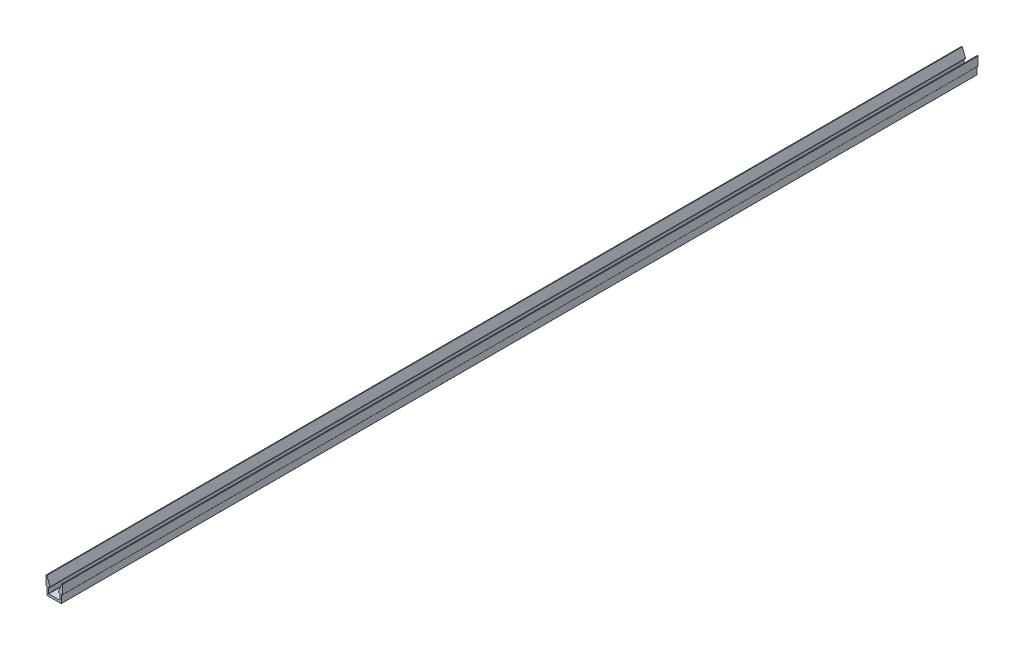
ISO-10303-21;
HEADER;
FILE_DESCRIPTION(('STEP AP214'),'2;1');
FILE_NAME('part.step','',(''),(''),'','','');
FILE_SCHEMA(('AUTOMOTIVE_DESIGN { 1 0 10303 214 1 1 1 1 }'));
ENDSEC;
DATA;
#1=APPLICATION_CONTEXT('core data for automotive mechanical design processes');
#2=APPLICATION_PROTOCOL_DEFINITION('international standard','automotive_design',2000,#1);
#3=PRODUCT_CONTEXT('',#1,'mechanical');
#4=PRODUCT('Part','Part','',(#3));
#5=PRODUCT_RELATED_PRODUCT_CATEGORY('part','',(#4));
#6=PRODUCT_DEFINITION_FORMATION('','',#4);
#7=PRODUCT_DEFINITION_CONTEXT('part definition',#1,'design');
#8=PRODUCT_DEFINITION('design','',#6,#7);
#9=PRODUCT_DEFINITION_SHAPE('','',#8);
#10=(LENGTH_UNIT() NAMED_UNIT(*) SI_UNIT(.MILLI.,.METRE.));
#11=(NAMED_UNIT(*) PLANE_ANGLE_UNIT() SI_UNIT($,.RADIAN.));
#12=(NAMED_UNIT(*) SI_UNIT($,.STERADIAN.) SOLID_ANGLE_UNIT());
#13=UNCERTAINTY_MEASURE_WITH_UNIT(LENGTH_MEASURE(1.E-05),#10,'distance_accuracy_value','');
#14=(GEOMETRIC_REPRESENTATION_CONTEXT(3) GLOBAL_UNCERTAINTY_ASSIGNED_CONTEXT((#13)) GLOBAL_UNIT_ASSIGNED_CONTEXT((#10,
#11,#12)) REPRESENTATION_CONTEXT('',''));
#15=CARTESIAN_POINT('',(0.,0.,0.));
#16=DIRECTION('',(0.,0.,1.));
#17=DIRECTION('',(1.,0.,0.));
#18=AXIS2_PLACEMENT_3D('',#15,#16,#17);
#19=CARTESIAN_POINT('',(3.1369,4.572,508.));
#20=DIRECTION('',(1.,0.,0.));
#21=DIRECTION('',(0.,1.,0.));
#22=AXIS2_PLACEMENT_3D('',#19,#20,#21);
#23=PLANE('',#22);
#24=DIRECTION('',(0.,-1.,0.));
#25=VECTOR('',#24,1.);
#26=CARTESIAN_POINT('',(3.1369,4.572,0.));
#27=LINE('',#26,#25);
#28=CARTESIAN_POINT('',(3.1369,4.572,0.));
#29=VERTEX_POINT('',#28);
#30=CARTESIAN_POINT('',(3.1369,1.397,0.));
#31=VERTEX_POINT('',#30);
#32=EDGE_CURVE('E214',#29,#31,#27,.T.);
#33=ORIENTED_EDGE('',*,*,#32,.T.);
#34=DIRECTION('',(0.,0.,-1.));
#35=VECTOR('',#34,1.);
#36=CARTESIAN_POINT('',(3.1369,1.397,508.));
#37=LINE('',#36,#35);
#38=CARTESIAN_POINT('',(3.1369,1.397,508.));
#39=VERTEX_POINT('',#38);
#40=EDGE_CURVE('E9',#39,#31,#37,.T.);
#41=ORIENTED_EDGE('',*,*,#40,.F.);
#42=DIRECTION('',(0.,-1.,0.));
#43=VECTOR('',#42,1.);
#44=CARTESIAN_POINT('',(3.1369,4.572,508.));
#45=LINE('',#44,#43);
#46=CARTESIAN_POINT('',(3.1369,4.572,508.));
#47=VERTEX_POINT('',#46);
#48=EDGE_CURVE('E285',#47,#39,#45,.T.);
#49=ORIENTED_EDGE('',*,*,#48,.F.);
#50=DIRECTION('',(0.,0.,-1.));
#51=VECTOR('',#50,1.);
#52=CARTESIAN_POINT('',(3.1369,4.572,508.));
#53=LINE('',#52,#51);
#54=EDGE_CURVE('E227',#47,#29,#53,.T.);
#55=ORIENTED_EDGE('',*,*,#54,.T.);
#56=EDGE_LOOP('',(#33,#41,#49,#55));
#57=FACE_BOUND('',#56,.T.);
#58=ADVANCED_FACE('F14',(#57),#23,.F.);
#59=CARTESIAN_POINT('',(3.0099,1.397,508.));
#60=DIRECTION('',(0.,0.,-1.));
#61=DIRECTION('',(-1.,0.,0.));
#62=AXIS2_PLACEMENT_3D('',#59,#60,#61);
#63=CYLINDRICAL_SURFACE('',#62,0.127);
#64=CARTESIAN_POINT('',(3.0099,1.397,0.));
#65=DIRECTION('',(0.,0.,-1.));
#66=DIRECTION('',(-1.,0.,0.));
#67=AXIS2_PLACEMENT_3D('',#64,#65,#66);
#68=CIRCLE('',#67,0.127);
#69=CARTESIAN_POINT('',(3.0099,1.27,0.));
#70=VERTEX_POINT('',#69);
#71=EDGE_CURVE('E210',#31,#70,#68,.T.);
#72=ORIENTED_EDGE('',*,*,#71,.T.);
#73=DIRECTION('',(0.,0.,-1.));
#74=VECTOR('',#73,1.);
#75=CARTESIAN_POINT('',(3.0099,1.27,508.));
#76=LINE('',#75,#74);
#77=CARTESIAN_POINT('',(3.0099,1.27,508.));
#78=VERTEX_POINT('',#77);
#79=EDGE_CURVE('E21',#78,#70,#76,.T.);
#80=ORIENTED_EDGE('',*,*,#79,.F.);
#81=CARTESIAN_POINT('',(3.0099,1.397,508.));
#82=DIRECTION('',(0.,0.,-1.));
#83=DIRECTION('',(-1.,0.,0.));
#84=AXIS2_PLACEMENT_3D('',#81,#82,#83);
#85=CIRCLE('',#84,0.127);
#86=EDGE_CURVE('E223',#39,#78,#85,.T.);
#87=ORIENTED_EDGE('',*,*,#86,.F.);
#88=ORIENTED_EDGE('',*,*,#40,.T.);
#89=EDGE_LOOP('',(#72,#80,#87,#88));
#90=FACE_BOUND('',#89,.T.);
#91=ADVANCED_FACE('F222',(#90),#63,.F.);
#92=CARTESIAN_POINT('',(3.0099,1.27,508.));
#93=DIRECTION('',(0.,-1.,0.));
#94=DIRECTION('',(0.,0.,-1.));
#95=AXIS2_PLACEMENT_3D('',#92,#93,#94);
#96=PLANE('',#95);
#97=DIRECTION('',(-1.,0.,0.));
#98=VECTOR('',#97,1.);
#99=CARTESIAN_POINT('',(3.0099,1.27,0.));
#100=LINE('',#99,#98);
#101=CARTESIAN_POINT('',(-3.0099,1.27,0.));
#102=VERTEX_POINT('',#101);
#103=EDGE_CURVE('E216',#70,#102,#100,.T.);
#104=ORIENTED_EDGE('',*,*,#103,.T.);
#105=DIRECTION('',(0.,0.,-1.));
#106=VECTOR('',#105,1.);
#107=CARTESIAN_POINT('',(-3.0099,1.27,508.));
#108=LINE('',#107,#106);
#109=CARTESIAN_POINT('',(-3.0099,1.27,508.));
#110=VERTEX_POINT('',#109);
#111=EDGE_CURVE('E421',#110,#102,#108,.T.);
#112=ORIENTED_EDGE('',*,*,#111,.F.);
#113=DIRECTION('',(-1.,0.,0.));
#114=VECTOR('',#113,1.);
#115=CARTESIAN_POINT('',(3.0099,1.27,508.));
#116=LINE('',#115,#114);
#117=EDGE_CURVE('E288',#78,#110,#116,.T.);
#118=ORIENTED_EDGE('',*,*,#117,.F.);
#119=ORIENTED_EDGE('',*,*,#79,.T.);
#120=EDGE_LOOP('',(#104,#112,#118,#119));
#121=FACE_BOUND('',#120,.T.);
#122=ADVANCED_FACE('F425',(#121),#96,.F.);
#123=CARTESIAN_POINT('',(-3.0099,1.397,508.));
#124=DIRECTION('',(0.,0.,-1.));
#125=DIRECTION('',(-1.,0.,0.));
#126=AXIS2_PLACEMENT_3D('',#123,#124,#125);
#127=CYLINDRICAL_SURFACE('',#126,0.127);
#128=CARTESIAN_POINT('',(-3.0099,1.397,0.));
#129=DIRECTION('',(0.,0.,-1.));
#130=DIRECTION('',(1.,0.,0.));
#131=AXIS2_PLACEMENT_3D('',#128,#129,#130);
#132=CIRCLE('',#131,0.127);
#133=CARTESIAN_POINT('',(-3.1369,1.397,0.));
#134=VERTEX_POINT('',#133);
#135=EDGE_CURVE('E231',#102,#134,#132,.T.);
#136=ORIENTED_EDGE('',*,*,#135,.T.);
#137=DIRECTION('',(0.,0.,-1.));
#138=VECTOR('',#137,1.);
#139=CARTESIAN_POINT('',(-3.1369,1.397,508.));
#140=LINE('',#139,#138);
#141=CARTESIAN_POINT('',(-3.1369,1.397,508.));
#142=VERTEX_POINT('',#141);
#143=EDGE_CURVE('E418',#142,#134,#140,.T.);
#144=ORIENTED_EDGE('',*,*,#143,.F.);
#145=CARTESIAN_POINT('',(-3.0099,1.397,508.));
#146=DIRECTION('',(0.,0.,-1.));
#147=DIRECTION('',(1.,0.,0.));
#148=AXIS2_PLACEMENT_3D('',#145,#146,#147);
#149=CIRCLE('',#148,0.127);
#150=EDGE_CURVE('E290',#110,#142,#149,.T.);
#151=ORIENTED_EDGE('',*,*,#150,.F.);
#152=ORIENTED_EDGE('',*,*,#111,.T.);
#153=EDGE_LOOP('',(#136,#144,#151,#152));
#154=FACE_BOUND('',#153,.T.);
#155=ADVANCED_FACE('F433',(#154),#127,.F.);
#156=CARTESIAN_POINT('',(-3.1369,4.572,508.));
#157=DIRECTION('',(-1.,0.,0.));
#158=DIRECTION('',(0.,-1.,0.));
#159=AXIS2_PLACEMENT_3D('',#156,#157,#158);
#160=PLANE('',#159);
#161=DIRECTION('',(0.,1.,0.));
#162=VECTOR('',#161,1.);
#163=CARTESIAN_POINT('',(-3.1369,4.572,0.));
#164=LINE('',#163,#162);
#165=CARTESIAN_POINT('',(-3.1369,4.572,0.));
#166=VERTEX_POINT('',#165);
#167=EDGE_CURVE('E233',#134,#166,#164,.T.);
#168=ORIENTED_EDGE('',*,*,#167,.T.);
#169=DIRECTION('',(0.,0.,-1.));
#170=VECTOR('',#169,1.);
#171=CARTESIAN_POINT('',(-3.1369,4.572,508.));
#172=LINE('',#171,#170);
#173=CARTESIAN_POINT('',(-3.1369,4.572,508.));
#174=VERTEX_POINT('',#173);
#175=EDGE_CURVE('E415',#174,#166,#172,.T.);
#176=ORIENTED_EDGE('',*,*,#175,.F.);
#177=DIRECTION('',(0.,1.,0.));
#178=VECTOR('',#177,1.);
#179=CARTESIAN_POINT('',(-3.1369,4.572,508.));
#180=LINE('',#179,#178);
#181=EDGE_CURVE('E292',#142,#174,#180,.T.);
#182=ORIENTED_EDGE('',*,*,#181,.F.);
#183=ORIENTED_EDGE('',*,*,#143,.T.);
#184=EDGE_LOOP('',(#168,#176,#182,#183));
#185=FACE_BOUND('',#184,.T.);
#186=ADVANCED_FACE('F436',(#185),#160,.F.);
#187=CARTESIAN_POINT('',(-2.70340250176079,4.572,508.));
#188=DIRECTION('',(0.,1.,0.));
#189=DIRECTION('',(-1.,0.,0.));
#190=AXIS2_PLACEMENT_3D('',#187,#188,#189);
#191=PLANE('',#190);
#192=DIRECTION('',(1.,0.,0.));
#193=VECTOR('',#192,1.);
#194=CARTESIAN_POINT('',(-2.70340250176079,4.572,0.));
#195=LINE('',#194,#193);
#196=CARTESIAN_POINT('',(-2.70340250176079,4.572,0.));
#197=VERTEX_POINT('',#196);
#198=EDGE_CURVE('E235',#166,#197,#195,.T.);
#199=ORIENTED_EDGE('',*,*,#198,.T.);
#200=DIRECTION('',(0.,0.,-1.));
#201=VECTOR('',#200,1.);
#202=CARTESIAN_POINT('',(-2.70340250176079,4.572,508.));
#203=LINE('',#202,#201);
#204=CARTESIAN_POINT('',(-2.70340250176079,4.572,508.));
#205=VERTEX_POINT('',#204);
#206=EDGE_CURVE('E412',#205,#197,#203,.T.);
#207=ORIENTED_EDGE('',*,*,#206,.F.);
#208=DIRECTION('',(1.,0.,0.));
#209=VECTOR('',#208,1.);
#210=CARTESIAN_POINT('',(-2.70340250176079,4.572,508.));
#211=LINE('',#210,#209);
#212=EDGE_CURVE('E294',#174,#205,#211,.T.);
#213=ORIENTED_EDGE('',*,*,#212,.F.);
#214=ORIENTED_EDGE('',*,*,#175,.T.);
#215=EDGE_LOOP('',(#199,#207,#213,#214));
#216=FACE_BOUND('',#215,.T.);
#217=ADVANCED_FACE('F441',(#216),#191,.F.);
#218=CARTESIAN_POINT('',(-2.70340250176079,4.953,508.));
#219=DIRECTION('',(0.,0.,-1.));
#220=DIRECTION('',(-1.,0.,0.));
#221=AXIS2_PLACEMENT_3D('',#218,#219,#220);
#222=CYLINDRICAL_SURFACE('',#221,0.381);
#223=CARTESIAN_POINT('',(-2.70340250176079,4.953,0.));
#224=DIRECTION('',(0.,0.,1.));
#225=DIRECTION('',(-1.,0.,0.));
#226=AXIS2_PLACEMENT_3D('',#223,#224,#225);
#227=CIRCLE('',#226,0.381);
#228=CARTESIAN_POINT('',(-2.35014545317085,5.09572511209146,0.));
#229=VERTEX_POINT('',#228);
#230=EDGE_CURVE('E237',#197,#229,#227,.T.);
#231=ORIENTED_EDGE('',*,*,#230,.T.);
#232=DIRECTION('',(0.,0.,-1.));
#233=VECTOR('',#232,1.);
#234=CARTESIAN_POINT('',(-2.35014545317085,5.09572511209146,508.));
#235=LINE('',#234,#233);
#236=CARTESIAN_POINT('',(-2.35014545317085,5.09572511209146,508.));
#237=VERTEX_POINT('',#236);
#238=EDGE_CURVE('E409',#237,#229,#235,.T.);
#239=ORIENTED_EDGE('',*,*,#238,.F.);
#240=CARTESIAN_POINT('',(-2.70340250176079,4.953,508.));
#241=DIRECTION('',(0.,0.,1.));
#242=DIRECTION('',(-1.,0.,0.));
#243=AXIS2_PLACEMENT_3D('',#240,#241,#242);
#244=CIRCLE('',#243,0.381);
#245=EDGE_CURVE('E296',#205,#237,#244,.T.);
#246=ORIENTED_EDGE('',*,*,#245,.F.);
#247=ORIENTED_EDGE('',*,*,#206,.T.);
#248=EDGE_LOOP('',(#231,#239,#246,#247));
#249=FACE_BOUND('',#248,.T.);
#250=ADVANCED_FACE('F447',(#249),#222,.T.);
#251=CARTESIAN_POINT('',(-4.15891023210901,9.57257503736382,508.));
#252=DIRECTION('',(-0.92718385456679,-0.374606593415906,0.));
#253=DIRECTION('',(0.374606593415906,-0.92718385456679,0.));
#254=AXIS2_PLACEMENT_3D('',#251,#252,#253);
#255=PLANE('',#254);
#256=DIRECTION('',(-0.374606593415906,0.92718385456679,0.));
#257=VECTOR('',#256,1.);
#258=CARTESIAN_POINT('',(-4.15891023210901,9.57257503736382,0.));
#259=LINE('',#258,#257);
#260=CARTESIAN_POINT('',(-4.158910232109,9.57257503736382,0.));
#261=VERTEX_POINT('',#260);
#262=EDGE_CURVE('E239',#229,#261,#259,.T.);
#263=ORIENTED_EDGE('',*,*,#262,.T.);
#264=DIRECTION('',(0.,0.,-1.));
#265=VECTOR('',#264,1.);
#266=CARTESIAN_POINT('',(-4.158910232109,9.57257503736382,508.));
#267=LINE('',#266,#265);
#268=CARTESIAN_POINT('',(-4.158910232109,9.57257503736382,508.));
#269=VERTEX_POINT('',#268);
#270=EDGE_CURVE('E406',#269,#261,#267,.T.);
#271=ORIENTED_EDGE('',*,*,#270,.F.);
#272=DIRECTION('',(-0.374606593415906,0.92718385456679,0.));
#273=VECTOR('',#272,1.);
#274=CARTESIAN_POINT('',(-4.15891023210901,9.57257503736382,508.));
#275=LINE('',#274,#273);
#276=EDGE_CURVE('E298',#237,#269,#275,.T.);
#277=ORIENTED_EDGE('',*,*,#276,.F.);
#278=ORIENTED_EDGE('',*,*,#238,.T.);
#279=EDGE_LOOP('',(#263,#271,#277,#278));
#280=FACE_BOUND('',#279,.T.);
#281=ADVANCED_FACE('F451',(#280),#255,.F.);
#282=CARTESIAN_POINT('',(-4.27666258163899,9.525,508.));
#283=DIRECTION('',(0.,0.,-1.));
#284=DIRECTION('',(-1.,0.,0.));
#285=AXIS2_PLACEMENT_3D('',#282,#283,#284);
#286=CYLINDRICAL_SURFACE('',#285,0.127);
#287=CARTESIAN_POINT('',(-4.27666258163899,9.525,0.));
#288=DIRECTION('',(0.,0.,1.));
#289=DIRECTION('',(-1.,0.,0.));
#290=AXIS2_PLACEMENT_3D('',#287,#288,#289);
#291=CIRCLE('',#290,0.127);
#292=CARTESIAN_POINT('',(-4.27666258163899,9.652,0.));
#293=VERTEX_POINT('',#292);
#294=EDGE_CURVE('E241',#261,#293,#291,.T.);
#295=ORIENTED_EDGE('',*,*,#294,.T.);
#296=DIRECTION('',(0.,0.,-1.));
#297=VECTOR('',#296,1.);
#298=CARTESIAN_POINT('',(-4.27666258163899,9.652,508.));
#299=LINE('',#298,#297);
#300=CARTESIAN_POINT('',(-4.27666258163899,9.652,508.));
#301=VERTEX_POINT('',#300);
#302=EDGE_CURVE('E403',#301,#293,#299,.T.);
#303=ORIENTED_EDGE('',*,*,#302,.F.);
#304=CARTESIAN_POINT('',(-4.27666258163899,9.525,508.));
#305=DIRECTION('',(0.,0.,1.));
#306=DIRECTION('',(-1.,0.,0.));
#307=AXIS2_PLACEMENT_3D('',#304,#305,#306);
#308=CIRCLE('',#307,0.127);
#309=EDGE_CURVE('E300',#269,#301,#308,.T.);
#310=ORIENTED_EDGE('',*,*,#309,.F.);
#311=ORIENTED_EDGE('',*,*,#270,.T.);
#312=EDGE_LOOP('',(#295,#303,#310,#311));
#313=FACE_BOUND('',#312,.T.);
#314=ADVANCED_FACE('F456',(#313),#286,.T.);
#315=CARTESIAN_POINT('',(-4.445,9.652,508.));
#316=DIRECTION('',(0.,-1.,0.));
#317=DIRECTION('',(1.,0.,0.));
#318=AXIS2_PLACEMENT_3D('',#315,#316,#317);
#319=PLANE('',#318);
#320=DIRECTION('',(-1.,0.,0.));
#321=VECTOR('',#320,1.);
#322=CARTESIAN_POINT('',(-4.445,9.652,0.));
#323=LINE('',#322,#321);
#324=CARTESIAN_POINT('',(-4.445,9.652,0.));
#325=VERTEX_POINT('',#324);
#326=EDGE_CURVE('E243',#293,#325,#323,.T.);
#327=ORIENTED_EDGE('',*,*,#326,.T.);
#328=DIRECTION('',(0.,0.,-1.));
#329=VECTOR('',#328,1.);
#330=CARTESIAN_POINT('',(-4.445,9.652,508.));
#331=LINE('',#330,#329);
#332=CARTESIAN_POINT('',(-4.445,9.652,508.));
#333=VERTEX_POINT('',#332);
#334=EDGE_CURVE('E400',#333,#325,#331,.T.);
#335=ORIENTED_EDGE('',*,*,#334,.F.);
#336=DIRECTION('',(-1.,0.,0.));
#337=VECTOR('',#336,1.);
#338=CARTESIAN_POINT('',(-4.445,9.652,508.));
#339=LINE('',#338,#337);
#340=EDGE_CURVE('E302',#301,#333,#339,.T.);
#341=ORIENTED_EDGE('',*,*,#340,.F.);
#342=ORIENTED_EDGE('',*,*,#302,.T.);
#343=EDGE_LOOP('',(#327,#335,#341,#342));
#344=FACE_BOUND('',#343,.T.);
#345=ADVANCED_FACE('F462',(#344),#319,.F.);
#346=CARTESIAN_POINT('',(-4.445,9.525,508.));
#347=DIRECTION('',(0.,0.,-1.));
#348=DIRECTION('',(-1.,0.,0.));
#349=AXIS2_PLACEMENT_3D('',#346,#347,#348);
#350=CYLINDRICAL_SURFACE('',#349,0.127);
#351=CARTESIAN_POINT('',(-4.445,9.525,0.));
#352=DIRECTION('',(0.,0.,1.));
#353=DIRECTION('',(-1.,0.,0.));
#354=AXIS2_PLACEMENT_3D('',#351,#352,#353);
#355=CIRCLE('',#354,0.127);
#356=CARTESIAN_POINT('',(-4.572,9.525,0.));
#357=VERTEX_POINT('',#356);
#358=EDGE_CURVE('E245',#325,#357,#355,.T.);
#359=ORIENTED_EDGE('',*,*,#358,.T.);
#360=DIRECTION('',(0.,0.,-1.));
#361=VECTOR('',#360,1.);
#362=CARTESIAN_POINT('',(-4.572,9.525,508.));
#363=LINE('',#362,#361);
#364=CARTESIAN_POINT('',(-4.572,9.525,508.));
#365=VERTEX_POINT('',#364);
#366=EDGE_CURVE('E397',#365,#357,#363,.T.);
#367=ORIENTED_EDGE('',*,*,#366,.F.);
#368=CARTESIAN_POINT('',(-4.445,9.525,508.));
#369=DIRECTION('',(0.,0.,1.));
#370=DIRECTION('',(-1.,0.,0.));
#371=AXIS2_PLACEMENT_3D('',#368,#369,#370);
#372=CIRCLE('',#371,0.127);
#373=EDGE_CURVE('E304',#333,#365,#372,.T.);
#374=ORIENTED_EDGE('',*,*,#373,.F.);
#375=ORIENTED_EDGE('',*,*,#334,.T.);
#376=EDGE_LOOP('',(#359,#367,#374,#375));
#377=FACE_BOUND('',#376,.T.);
#378=ADVANCED_FACE('F466',(#377),#350,.T.);
#379=CARTESIAN_POINT('',(-4.572,4.699,508.));
#380=DIRECTION('',(1.,0.,0.));
#381=DIRECTION('',(0.,1.,0.));
#382=AXIS2_PLACEMENT_3D('',#379,#380,#381);
#383=PLANE('',#382);
#384=DIRECTION('',(0.,-1.,0.));
#385=VECTOR('',#384,1.);
#386=CARTESIAN_POINT('',(-4.572,4.699,0.));
#387=LINE('',#386,#385);
#388=CARTESIAN_POINT('',(-4.572,4.699,0.));
#389=VERTEX_POINT('',#388);
#390=EDGE_CURVE('E247',#357,#389,#387,.T.);
#391=ORIENTED_EDGE('',*,*,#390,.T.);
#392=DIRECTION('',(0.,0.,-1.));
#393=VECTOR('',#392,1.);
#394=CARTESIAN_POINT('',(-4.572,4.699,508.));
#395=LINE('',#394,#393);
#396=CARTESIAN_POINT('',(-4.572,4.699,508.));
#397=VERTEX_POINT('',#396);
#398=EDGE_CURVE('E394',#397,#389,#395,.T.);
#399=ORIENTED_EDGE('',*,*,#398,.F.);
#400=DIRECTION('',(0.,-1.,0.));
#401=VECTOR('',#400,1.);
#402=CARTESIAN_POINT('',(-4.572,4.699,508.));
#403=LINE('',#402,#401);
#404=EDGE_CURVE('E306',#365,#397,#403,.T.);
#405=ORIENTED_EDGE('',*,*,#404,.F.);
#406=ORIENTED_EDGE('',*,*,#366,.T.);
#407=EDGE_LOOP('',(#391,#399,#405,#406));
#408=FACE_BOUND('',#407,.T.);
#409=ADVANCED_FACE('F471',(#408),#383,.F.);
#410=CARTESIAN_POINT('',(-4.445,4.699,508.));
#411=DIRECTION('',(0.,0.,-1.));
#412=DIRECTION('',(-1.,0.,0.));
#413=AXIS2_PLACEMENT_3D('',#410,#411,#412);
#414=CYLINDRICAL_SURFACE('',#413,0.127);
#415=CARTESIAN_POINT('',(-4.445,4.699,0.));
#416=DIRECTION('',(0.,0.,1.));
#417=DIRECTION('',(-1.,0.,0.));
#418=AXIS2_PLACEMENT_3D('',#415,#416,#417);
#419=CIRCLE('',#418,0.127);
#420=CARTESIAN_POINT('',(-4.445,4.572,0.));
#421=VERTEX_POINT('',#420);
#422=EDGE_CURVE('E249',#389,#421,#419,.T.);
#423=ORIENTED_EDGE('',*,*,#422,.T.);
#424=DIRECTION('',(0.,0.,-1.));
#425=VECTOR('',#424,1.);
#426=CARTESIAN_POINT('',(-4.445,4.572,508.));
#427=LINE('',#426,#425);
#428=CARTESIAN_POINT('',(-4.445,4.572,508.));
#429=VERTEX_POINT('',#428);
#430=EDGE_CURVE('E391',#429,#421,#427,.T.);
#431=ORIENTED_EDGE('',*,*,#430,.F.);
#432=CARTESIAN_POINT('',(-4.445,4.699,508.));
#433=DIRECTION('',(0.,0.,1.));
#434=DIRECTION('',(-1.,0.,0.));
#435=AXIS2_PLACEMENT_3D('',#432,#433,#434);
#436=CIRCLE('',#435,0.127);
#437=EDGE_CURVE('E308',#397,#429,#436,.T.);
#438=ORIENTED_EDGE('',*,*,#437,.F.);
#439=ORIENTED_EDGE('',*,*,#398,.T.);
#440=EDGE_LOOP('',(#423,#431,#438,#439));
#441=FACE_BOUND('',#440,.T.);
#442=ADVANCED_FACE('F477',(#441),#414,.T.);
#443=CARTESIAN_POINT('',(-4.064,4.572,508.));
#444=DIRECTION('',(0.,1.,0.));
#445=DIRECTION('',(0.,0.,1.));
#446=AXIS2_PLACEMENT_3D('',#443,#444,#445);
#447=PLANE('',#446);
#448=DIRECTION('',(1.,0.,0.));
#449=VECTOR('',#448,1.);
#450=CARTESIAN_POINT('',(-4.064,4.572,0.));
#451=LINE('',#450,#449);
#452=CARTESIAN_POINT('',(-4.064,4.572,0.));
#453=VERTEX_POINT('',#452);
#454=EDGE_CURVE('E251',#421,#453,#451,.T.);
#455=ORIENTED_EDGE('',*,*,#454,.T.);
#456=DIRECTION('',(0.,0.,-1.));
#457=VECTOR('',#456,1.);
#458=CARTESIAN_POINT('',(-4.064,4.572,508.));
#459=LINE('',#458,#457);
#460=CARTESIAN_POINT('',(-4.064,4.572,508.));
#461=VERTEX_POINT('',#460);
#462=EDGE_CURVE('E388',#461,#453,#459,.T.);
#463=ORIENTED_EDGE('',*,*,#462,.F.);
#464=DIRECTION('',(1.,0.,0.));
#465=VECTOR('',#464,1.);
#466=CARTESIAN_POINT('',(-4.064,4.572,508.));
#467=LINE('',#466,#465);
#468=EDGE_CURVE('E310',#429,#461,#467,.T.);
#469=ORIENTED_EDGE('',*,*,#468,.F.);
#470=ORIENTED_EDGE('',*,*,#430,.T.);
#471=EDGE_LOOP('',(#455,#463,#469,#470));
#472=FACE_BOUND('',#471,.T.);
#473=ADVANCED_FACE('F481',(#472),#447,.F.);
#474=CARTESIAN_POINT('',(-4.064,4.445,508.));
#475=DIRECTION('',(0.,0.,-1.));
#476=DIRECTION('',(-1.,0.,0.));
#477=AXIS2_PLACEMENT_3D('',#474,#475,#476);
#478=CYLINDRICAL_SURFACE('',#477,0.127);
#479=CARTESIAN_POINT('',(-4.064,4.445,0.));
#480=DIRECTION('',(0.,0.,-1.));
#481=DIRECTION('',(1.,0.,0.));
#482=AXIS2_PLACEMENT_3D('',#479,#480,#481);
#483=CIRCLE('',#482,0.127);
#484=CARTESIAN_POINT('',(-3.937,4.445,0.));
#485=VERTEX_POINT('',#484);
#486=EDGE_CURVE('E253',#453,#485,#483,.T.);
#487=ORIENTED_EDGE('',*,*,#486,.T.);
#488=DIRECTION('',(0.,0.,-1.));
#489=VECTOR('',#488,1.);
#490=CARTESIAN_POINT('',(-3.937,4.445,508.));
#491=LINE('',#490,#489);
#492=CARTESIAN_POINT('',(-3.937,4.445,508.));
#493=VERTEX_POINT('',#492);
#494=EDGE_CURVE('E385',#493,#485,#491,.T.);
#495=ORIENTED_EDGE('',*,*,#494,.F.);
#496=CARTESIAN_POINT('',(-4.064,4.445,508.));
#497=DIRECTION('',(0.,0.,-1.));
#498=DIRECTION('',(1.,0.,0.));
#499=AXIS2_PLACEMENT_3D('',#496,#497,#498);
#500=CIRCLE('',#499,0.127);
#501=EDGE_CURVE('E312',#461,#493,#500,.T.);
#502=ORIENTED_EDGE('',*,*,#501,.F.);
#503=ORIENTED_EDGE('',*,*,#462,.T.);
#504=EDGE_LOOP('',(#487,#495,#502,#503));
#505=FACE_BOUND('',#504,.T.);
#506=ADVANCED_FACE('F486',(#505),#478,.F.);
#507=CARTESIAN_POINT('',(-3.937,0.127,508.));
#508=DIRECTION('',(1.,0.,0.));
#509=DIRECTION('',(0.,0.,-1.));
#510=AXIS2_PLACEMENT_3D('',#507,#508,#509);
#511=PLANE('',#510);
#512=DIRECTION('',(0.,-1.,0.));
#513=VECTOR('',#512,1.);
#514=CARTESIAN_POINT('',(-3.937,0.127,0.));
#515=LINE('',#514,#513);
#516=CARTESIAN_POINT('',(-3.937,0.127,0.));
#517=VERTEX_POINT('',#516);
#518=EDGE_CURVE('E255',#485,#517,#515,.T.);
#519=ORIENTED_EDGE('',*,*,#518,.T.);
#520=DIRECTION('',(0.,0.,-1.));
#521=VECTOR('',#520,1.);
#522=CARTESIAN_POINT('',(-3.937,0.127,508.));
#523=LINE('',#522,#521);
#524=CARTESIAN_POINT('',(-3.937,0.127,508.));
#525=VERTEX_POINT('',#524);
#526=EDGE_CURVE('E382',#525,#517,#523,.T.);
#527=ORIENTED_EDGE('',*,*,#526,.F.);
#528=DIRECTION('',(0.,-1.,0.));
#529=VECTOR('',#528,1.);
#530=CARTESIAN_POINT('',(-3.937,0.127,508.));
#531=LINE('',#530,#529);
#532=EDGE_CURVE('E314',#493,#525,#531,.T.);
#533=ORIENTED_EDGE('',*,*,#532,.F.);
#534=ORIENTED_EDGE('',*,*,#494,.T.);
#535=EDGE_LOOP('',(#519,#527,#533,#534));
#536=FACE_BOUND('',#535,.T.);
#537=ADVANCED_FACE('F492',(#536),#511,.F.);
#538=CARTESIAN_POINT('',(-3.81,0.127,508.));
#539=DIRECTION('',(0.,0.,-1.));
#540=DIRECTION('',(-1.,0.,0.));
#541=AXIS2_PLACEMENT_3D('',#538,#539,#540);
#542=CYLINDRICAL_SURFACE('',#541,0.127);
#543=CARTESIAN_POINT('',(-3.81,0.127,0.));
#544=DIRECTION('',(0.,0.,1.));
#545=DIRECTION('',(-1.,0.,0.));
#546=AXIS2_PLACEMENT_3D('',#543,#544,#545);
#547=CIRCLE('',#546,0.127);
#548=CARTESIAN_POINT('',(-3.81,0.,0.));
#549=VERTEX_POINT('',#548);
#550=EDGE_CURVE('E257',#517,#549,#547,.T.);
#551=ORIENTED_EDGE('',*,*,#550,.T.);
#552=DIRECTION('',(0.,0.,-1.));
#553=VECTOR('',#552,1.);
#554=CARTESIAN_POINT('',(-3.81,0.,508.));
#555=LINE('',#554,#553);
#556=CARTESIAN_POINT('',(-3.81,0.,508.));
#557=VERTEX_POINT('',#556);
#558=EDGE_CURVE('E379',#557,#549,#555,.T.);
#559=ORIENTED_EDGE('',*,*,#558,.F.);
#560=CARTESIAN_POINT('',(-3.81,0.127,508.));
#561=DIRECTION('',(0.,0.,1.));
#562=DIRECTION('',(-1.,0.,0.));
#563=AXIS2_PLACEMENT_3D('',#560,#561,#562);
#564=CIRCLE('',#563,0.127);
#565=EDGE_CURVE('E316',#525,#557,#564,.T.);
#566=ORIENTED_EDGE('',*,*,#565,.F.);
#567=ORIENTED_EDGE('',*,*,#526,.T.);
#568=EDGE_LOOP('',(#551,#559,#566,#567));
#569=FACE_BOUND('',#568,.T.);
#570=ADVANCED_FACE('F496',(#569),#542,.T.);
#571=CARTESIAN_POINT('',(-3.81,0.,508.));
#572=DIRECTION('',(0.,1.,0.));
#573=DIRECTION('',(0.,0.,1.));
#574=AXIS2_PLACEMENT_3D('',#571,#572,#573);
#575=PLANE('',#574);
#576=DIRECTION('',(1.,0.,0.));
#577=VECTOR('',#576,1.);
#578=CARTESIAN_POINT('',(-3.81,0.,0.));
#579=LINE('',#578,#577);
#580=CARTESIAN_POINT('',(3.81,0.,0.));
#581=VERTEX_POINT('',#580);
#582=EDGE_CURVE('E259',#549,#581,#579,.T.);
#583=ORIENTED_EDGE('',*,*,#582,.T.);
#584=DIRECTION('',(0.,0.,-1.));
#585=VECTOR('',#584,1.);
#586=CARTESIAN_POINT('',(3.81,0.,508.));
#587=LINE('',#586,#585);
#588=CARTESIAN_POINT('',(3.81,0.,508.));
#589=VERTEX_POINT('',#588);
#590=EDGE_CURVE('E376',#589,#581,#587,.T.);
#591=ORIENTED_EDGE('',*,*,#590,.F.);
#592=DIRECTION('',(1.,0.,0.));
#593=VECTOR('',#592,1.);
#594=CARTESIAN_POINT('',(-3.81,0.,508.));
#595=LINE('',#594,#593);
#596=EDGE_CURVE('E318',#557,#589,#595,.T.);
#597=ORIENTED_EDGE('',*,*,#596,.F.);
#598=ORIENTED_EDGE('',*,*,#558,.T.);
#599=EDGE_LOOP('',(#583,#591,#597,#598));
#600=FACE_BOUND('',#599,.T.);
#601=ADVANCED_FACE('F501',(#600),#575,.F.);
#602=CARTESIAN_POINT('',(3.81,0.127,508.));
#603=DIRECTION('',(0.,0.,-1.));
#604=DIRECTION('',(-1.,0.,0.));
#605=AXIS2_PLACEMENT_3D('',#602,#603,#604);
#606=CYLINDRICAL_SURFACE('',#605,0.127);
#607=CARTESIAN_POINT('',(3.81,0.127,0.));
#608=DIRECTION('',(0.,0.,1.));
#609=DIRECTION('',(1.,0.,0.));
#610=AXIS2_PLACEMENT_3D('',#607,#608,#609);
#611=CIRCLE('',#610,0.127);
#612=CARTESIAN_POINT('',(3.937,0.127,0.));
#613=VERTEX_POINT('',#612);
#614=EDGE_CURVE('E261',#581,#613,#611,.T.);
#615=ORIENTED_EDGE('',*,*,#614,.T.);
#616=DIRECTION('',(0.,0.,-1.));
#617=VECTOR('',#616,1.);
#618=CARTESIAN_POINT('',(3.937,0.127,508.));
#619=LINE('',#618,#617);
#620=CARTESIAN_POINT('',(3.937,0.127,508.));
#621=VERTEX_POINT('',#620);
#622=EDGE_CURVE('E373',#621,#613,#619,.T.);
#623=ORIENTED_EDGE('',*,*,#622,.F.);
#624=CARTESIAN_POINT('',(3.81,0.127,508.));
#625=DIRECTION('',(0.,0.,1.));
#626=DIRECTION('',(1.,0.,0.));
#627=AXIS2_PLACEMENT_3D('',#624,#625,#626);
#628=CIRCLE('',#627,0.127);
#629=EDGE_CURVE('E320',#589,#621,#628,.T.);
#630=ORIENTED_EDGE('',*,*,#629,.F.);
#631=ORIENTED_EDGE('',*,*,#590,.T.);
#632=EDGE_LOOP('',(#615,#623,#630,#631));
#633=FACE_BOUND('',#632,.T.);
#634=ADVANCED_FACE('F507',(#633),#606,.T.);
#635=CARTESIAN_POINT('',(3.937,0.127,508.));
#636=DIRECTION('',(-1.,0.,0.));
#637=DIRECTION('',(0.,0.,1.));
#638=AXIS2_PLACEMENT_3D('',#635,#636,#637);
#639=PLANE('',#638);
#640=DIRECTION('',(0.,1.,0.));
#641=VECTOR('',#640,1.);
#642=CARTESIAN_POINT('',(3.937,0.127,0.));
#643=LINE('',#642,#641);
#644=CARTESIAN_POINT('',(3.937,4.445,0.));
#645=VERTEX_POINT('',#644);
#646=EDGE_CURVE('E263',#613,#645,#643,.T.);
#647=ORIENTED_EDGE('',*,*,#646,.T.);
#648=DIRECTION('',(0.,0.,-1.));
#649=VECTOR('',#648,1.);
#650=CARTESIAN_POINT('',(3.937,4.445,508.));
#651=LINE('',#650,#649);
#652=CARTESIAN_POINT('',(3.937,4.445,508.));
#653=VERTEX_POINT('',#652);
#654=EDGE_CURVE('E370',#653,#645,#651,.T.);
#655=ORIENTED_EDGE('',*,*,#654,.F.);
#656=DIRECTION('',(0.,1.,0.));
#657=VECTOR('',#656,1.);
#658=CARTESIAN_POINT('',(3.937,0.127,508.));
#659=LINE('',#658,#657);
#660=EDGE_CURVE('E322',#621,#653,#659,.T.);
#661=ORIENTED_EDGE('',*,*,#660,.F.);
#662=ORIENTED_EDGE('',*,*,#622,.T.);
#663=EDGE_LOOP('',(#647,#655,#661,#662));
#664=FACE_BOUND('',#663,.T.);
#665=ADVANCED_FACE('F511',(#664),#639,.F.);
#666=CARTESIAN_POINT('',(4.064,4.445,508.));
#667=DIRECTION('',(0.,0.,-1.));
#668=DIRECTION('',(-1.,0.,0.));
#669=AXIS2_PLACEMENT_3D('',#666,#667,#668);
#670=CYLINDRICAL_SURFACE('',#669,0.127);
#671=CARTESIAN_POINT('',(4.064,4.445,0.));
#672=DIRECTION('',(0.,0.,-1.));
#673=DIRECTION('',(-1.,0.,0.));
#674=AXIS2_PLACEMENT_3D('',#671,#672,#673);
#675=CIRCLE('',#674,0.127);
#676=CARTESIAN_POINT('',(4.064,4.572,0.));
#677=VERTEX_POINT('',#676);
#678=EDGE_CURVE('E265',#645,#677,#675,.T.);
#679=ORIENTED_EDGE('',*,*,#678,.T.);
#680=DIRECTION('',(0.,0.,-1.));
#681=VECTOR('',#680,1.);
#682=CARTESIAN_POINT('',(4.064,4.572,508.));
#683=LINE('',#682,#681);
#684=CARTESIAN_POINT('',(4.064,4.572,508.));
#685=VERTEX_POINT('',#684);
#686=EDGE_CURVE('E367',#685,#677,#683,.T.);
#687=ORIENTED_EDGE('',*,*,#686,.F.);
#688=CARTESIAN_POINT('',(4.064,4.445,508.));
#689=DIRECTION('',(0.,0.,-1.));
#690=DIRECTION('',(-1.,0.,0.));
#691=AXIS2_PLACEMENT_3D('',#688,#689,#690);
#692=CIRCLE('',#691,0.127);
#693=EDGE_CURVE('E324',#653,#685,#692,.T.);
#694=ORIENTED_EDGE('',*,*,#693,.F.);
#695=ORIENTED_EDGE('',*,*,#654,.T.);
#696=EDGE_LOOP('',(#679,#687,#694,#695));
#697=FACE_BOUND('',#696,.T.);
#698=ADVANCED_FACE('F516',(#697),#670,.F.);
#699=CARTESIAN_POINT('',(4.064,4.572,508.));
#700=DIRECTION('',(0.,1.,0.));
#701=DIRECTION('',(0.,0.,1.));
#702=AXIS2_PLACEMENT_3D('',#699,#700,#701);
#703=PLANE('',#702);
#704=DIRECTION('',(1.,0.,0.));
#705=VECTOR('',#704,1.);
#706=CARTESIAN_POINT('',(4.064,4.572,0.));
#707=LINE('',#706,#705);
#708=CARTESIAN_POINT('',(4.445,4.572,0.));
#709=VERTEX_POINT('',#708);
#710=EDGE_CURVE('E267',#677,#709,#707,.T.);
#711=ORIENTED_EDGE('',*,*,#710,.T.);
#712=DIRECTION('',(0.,0.,-1.));
#713=VECTOR('',#712,1.);
#714=CARTESIAN_POINT('',(4.445,4.572,508.));
#715=LINE('',#714,#713);
#716=CARTESIAN_POINT('',(4.445,4.572,508.));
#717=VERTEX_POINT('',#716);
#718=EDGE_CURVE('E364',#717,#709,#715,.T.);
#719=ORIENTED_EDGE('',*,*,#718,.F.);
#720=DIRECTION('',(1.,0.,0.));
#721=VECTOR('',#720,1.);
#722=CARTESIAN_POINT('',(4.064,4.572,508.));
#723=LINE('',#722,#721);
#724=EDGE_CURVE('E326',#685,#717,#723,.T.);
#725=ORIENTED_EDGE('',*,*,#724,.F.);
#726=ORIENTED_EDGE('',*,*,#686,.T.);
#727=EDGE_LOOP('',(#711,#719,#725,#726));
#728=FACE_BOUND('',#727,.T.);
#729=ADVANCED_FACE('F522',(#728),#703,.F.);
#730=CARTESIAN_POINT('',(4.445,4.699,508.));
#731=DIRECTION('',(0.,0.,-1.));
#732=DIRECTION('',(-1.,0.,0.));
#733=AXIS2_PLACEMENT_3D('',#730,#731,#732);
#734=CYLINDRICAL_SURFACE('',#733,0.127);
#735=CARTESIAN_POINT('',(4.445,4.699,0.));
#736=DIRECTION('',(0.,0.,1.));
#737=DIRECTION('',(1.,0.,0.));
#738=AXIS2_PLACEMENT_3D('',#735,#736,#737);
#739=CIRCLE('',#738,0.127);
#740=CARTESIAN_POINT('',(4.572,4.699,0.));
#741=VERTEX_POINT('',#740);
#742=EDGE_CURVE('E269',#709,#741,#739,.T.);
#743=ORIENTED_EDGE('',*,*,#742,.T.);
#744=DIRECTION('',(0.,0.,-1.));
#745=VECTOR('',#744,1.);
#746=CARTESIAN_POINT('',(4.572,4.699,508.));
#747=LINE('',#746,#745);
#748=CARTESIAN_POINT('',(4.572,4.699,508.));
#749=VERTEX_POINT('',#748);
#750=EDGE_CURVE('E361',#749,#741,#747,.T.);
#751=ORIENTED_EDGE('',*,*,#750,.F.);
#752=CARTESIAN_POINT('',(4.445,4.699,508.));
#753=DIRECTION('',(0.,0.,1.));
#754=DIRECTION('',(1.,0.,0.));
#755=AXIS2_PLACEMENT_3D('',#752,#753,#754);
#756=CIRCLE('',#755,0.127);
#757=EDGE_CURVE('E328',#717,#749,#756,.T.);
#758=ORIENTED_EDGE('',*,*,#757,.F.);
#759=ORIENTED_EDGE('',*,*,#718,.T.);
#760=EDGE_LOOP('',(#743,#751,#758,#759));
#761=FACE_BOUND('',#760,.T.);
#762=ADVANCED_FACE('F526',(#761),#734,.T.);
#763=CARTESIAN_POINT('',(4.572,4.699,508.));
#764=DIRECTION('',(-1.,0.,0.));
#765=DIRECTION('',(0.,-1.,0.));
#766=AXIS2_PLACEMENT_3D('',#763,#764,#765);
#767=PLANE('',#766);
#768=DIRECTION('',(0.,1.,0.));
#769=VECTOR('',#768,1.);
#770=CARTESIAN_POINT('',(4.572,4.699,0.));
#771=LINE('',#770,#769);
#772=CARTESIAN_POINT('',(4.572,9.525,0.));
#773=VERTEX_POINT('',#772);
#774=EDGE_CURVE('E271',#741,#773,#771,.T.);
#775=ORIENTED_EDGE('',*,*,#774,.T.);
#776=DIRECTION('',(0.,0.,-1.));
#777=VECTOR('',#776,1.);
#778=CARTESIAN_POINT('',(4.572,9.525,508.));
#779=LINE('',#778,#777);
#780=CARTESIAN_POINT('',(4.572,9.525,508.));
#781=VERTEX_POINT('',#780);
#782=EDGE_CURVE('E358',#781,#773,#779,.T.);
#783=ORIENTED_EDGE('',*,*,#782,.F.);
#784=DIRECTION('',(0.,1.,0.));
#785=VECTOR('',#784,1.);
#786=CARTESIAN_POINT('',(4.572,4.699,508.));
#787=LINE('',#786,#785);
#788=EDGE_CURVE('E330',#749,#781,#787,.T.);
#789=ORIENTED_EDGE('',*,*,#788,.F.);
#790=ORIENTED_EDGE('',*,*,#750,.T.);
#791=EDGE_LOOP('',(#775,#783,#789,#790));
#792=FACE_BOUND('',#791,.T.);
#793=ADVANCED_FACE('F531',(#792),#767,.F.);
#794=CARTESIAN_POINT('',(4.445,9.525,508.));
#795=DIRECTION('',(0.,0.,-1.));
#796=DIRECTION('',(-1.,0.,0.));
#797=AXIS2_PLACEMENT_3D('',#794,#795,#796);
#798=CYLINDRICAL_SURFACE('',#797,0.127);
#799=CARTESIAN_POINT('',(4.445,9.525,0.));
#800=DIRECTION('',(0.,0.,1.));
#801=DIRECTION('',(1.,0.,0.));
#802=AXIS2_PLACEMENT_3D('',#799,#800,#801);
#803=CIRCLE('',#802,0.127);
#804=CARTESIAN_POINT('',(4.445,9.652,0.));
#805=VERTEX_POINT('',#804);
#806=EDGE_CURVE('E273',#773,#805,#803,.T.);
#807=ORIENTED_EDGE('',*,*,#806,.T.);
#808=DIRECTION('',(0.,0.,-1.));
#809=VECTOR('',#808,1.);
#810=CARTESIAN_POINT('',(4.445,9.652,508.));
#811=LINE('',#810,#809);
#812=CARTESIAN_POINT('',(4.445,9.652,508.));
#813=VERTEX_POINT('',#812);
#814=EDGE_CURVE('E355',#813,#805,#811,.T.);
#815=ORIENTED_EDGE('',*,*,#814,.F.);
#816=CARTESIAN_POINT('',(4.445,9.525,508.));
#817=DIRECTION('',(0.,0.,1.));
#818=DIRECTION('',(1.,0.,0.));
#819=AXIS2_PLACEMENT_3D('',#816,#817,#818);
#820=CIRCLE('',#819,0.127);
#821=EDGE_CURVE('E332',#781,#813,#820,.T.);
#822=ORIENTED_EDGE('',*,*,#821,.F.);
#823=ORIENTED_EDGE('',*,*,#782,.T.);
#824=EDGE_LOOP('',(#807,#815,#822,#823));
#825=FACE_BOUND('',#824,.T.);
#826=ADVANCED_FACE('F537',(#825),#798,.T.);
#827=CARTESIAN_POINT('',(4.445,9.652,508.));
#828=DIRECTION('',(0.,-1.,0.));
#829=DIRECTION('',(1.,0.,0.));
#830=AXIS2_PLACEMENT_3D('',#827,#828,#829);
#831=PLANE('',#830);
#832=DIRECTION('',(-1.,0.,0.));
#833=VECTOR('',#832,1.);
#834=CARTESIAN_POINT('',(4.445,9.652,0.));
#835=LINE('',#834,#833);
#836=CARTESIAN_POINT('',(4.27666258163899,9.652,0.));
#837=VERTEX_POINT('',#836);
#838=EDGE_CURVE('E275',#805,#837,#835,.T.);
#839=ORIENTED_EDGE('',*,*,#838,.T.);
#840=DIRECTION('',(0.,0.,-1.));
#841=VECTOR('',#840,1.);
#842=CARTESIAN_POINT('',(4.27666258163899,9.652,508.));
#843=LINE('',#842,#841);
#844=CARTESIAN_POINT('',(4.27666258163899,9.652,508.));
#845=VERTEX_POINT('',#844);
#846=EDGE_CURVE('E352',#845,#837,#843,.T.);
#847=ORIENTED_EDGE('',*,*,#846,.F.);
#848=DIRECTION('',(-1.,0.,0.));
#849=VECTOR('',#848,1.);
#850=CARTESIAN_POINT('',(4.445,9.652,508.));
#851=LINE('',#850,#849);
#852=EDGE_CURVE('E334',#813,#845,#851,.T.);
#853=ORIENTED_EDGE('',*,*,#852,.F.);
#854=ORIENTED_EDGE('',*,*,#814,.T.);
#855=EDGE_LOOP('',(#839,#847,#853,#854));
#856=FACE_BOUND('',#855,.T.);
#857=ADVANCED_FACE('F541',(#856),#831,.F.);
#858=CARTESIAN_POINT('',(4.27666258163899,9.525,508.));
#859=DIRECTION('',(0.,0.,-1.));
#860=DIRECTION('',(-1.,0.,0.));
#861=AXIS2_PLACEMENT_3D('',#858,#859,#860);
#862=CYLINDRICAL_SURFACE('',#861,0.127);
#863=CARTESIAN_POINT('',(4.27666258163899,9.525,0.));
#864=DIRECTION('',(0.,0.,1.));
#865=DIRECTION('',(1.,0.,0.));
#866=AXIS2_PLACEMENT_3D('',#863,#864,#865);
#867=CIRCLE('',#866,0.127);
#868=CARTESIAN_POINT('',(4.15891023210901,9.57257503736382,0.));
#869=VERTEX_POINT('',#868);
#870=EDGE_CURVE('E277',#837,#869,#867,.T.);
#871=ORIENTED_EDGE('',*,*,#870,.T.);
#872=DIRECTION('',(0.,0.,-1.));
#873=VECTOR('',#872,1.);
#874=CARTESIAN_POINT('',(4.15891023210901,9.57257503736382,508.));
#875=LINE('',#874,#873);
#876=CARTESIAN_POINT('',(4.15891023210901,9.57257503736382,508.));
#877=VERTEX_POINT('',#876);
#878=EDGE_CURVE('E349',#877,#869,#875,.T.);
#879=ORIENTED_EDGE('',*,*,#878,.F.);
#880=CARTESIAN_POINT('',(4.27666258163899,9.525,508.));
#881=DIRECTION('',(0.,0.,1.));
#882=DIRECTION('',(1.,0.,0.));
#883=AXIS2_PLACEMENT_3D('',#880,#881,#882);
#884=CIRCLE('',#883,0.127);
#885=EDGE_CURVE('E336',#845,#877,#884,.T.);
#886=ORIENTED_EDGE('',*,*,#885,.F.);
#887=ORIENTED_EDGE('',*,*,#846,.T.);
#888=EDGE_LOOP('',(#871,#879,#886,#887));
#889=FACE_BOUND('',#888,.T.);
#890=ADVANCED_FACE('F546',(#889),#862,.T.);
#891=CARTESIAN_POINT('',(4.15891023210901,9.57257503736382,508.));
#892=DIRECTION('',(0.92718385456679,-0.374606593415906,0.));
#893=DIRECTION('',(0.374606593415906,0.92718385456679,0.));
#894=AXIS2_PLACEMENT_3D('',#891,#892,#893);
#895=PLANE('',#894);
#896=DIRECTION('',(-0.374606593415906,-0.92718385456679,0.));
#897=VECTOR('',#896,1.);
#898=CARTESIAN_POINT('',(4.15891023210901,9.57257503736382,0.));
#899=LINE('',#898,#897);
#900=CARTESIAN_POINT('',(2.35014545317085,5.09572511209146,0.));
#901=VERTEX_POINT('',#900);
#902=EDGE_CURVE('E279',#869,#901,#899,.T.);
#903=ORIENTED_EDGE('',*,*,#902,.T.);
#904=DIRECTION('',(0.,0.,-1.));
#905=VECTOR('',#904,1.);
#906=CARTESIAN_POINT('',(2.35014545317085,5.09572511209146,508.));
#907=LINE('',#906,#905);
#908=CARTESIAN_POINT('',(2.35014545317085,5.09572511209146,508.));
#909=VERTEX_POINT('',#908);
#910=EDGE_CURVE('E346',#909,#901,#907,.T.);
#911=ORIENTED_EDGE('',*,*,#910,.F.);
#912=DIRECTION('',(-0.374606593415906,-0.92718385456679,0.));
#913=VECTOR('',#912,1.);
#914=CARTESIAN_POINT('',(4.15891023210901,9.57257503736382,508.));
#915=LINE('',#914,#913);
#916=EDGE_CURVE('E338',#877,#909,#915,.T.);
#917=ORIENTED_EDGE('',*,*,#916,.F.);
#918=ORIENTED_EDGE('',*,*,#878,.T.);
#919=EDGE_LOOP('',(#903,#911,#917,#918));
#920=FACE_BOUND('',#919,.T.);
#921=ADVANCED_FACE('F550',(#920),#895,.F.);
#922=CARTESIAN_POINT('',(2.70340250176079,4.953,508.));
#923=DIRECTION('',(0.,0.,-1.));
#924=DIRECTION('',(-1.,0.,0.));
#925=AXIS2_PLACEMENT_3D('',#922,#923,#924);
#926=CYLINDRICAL_SURFACE('',#925,0.381);
#927=CARTESIAN_POINT('',(2.70340250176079,4.953,0.));
#928=DIRECTION('',(0.,0.,1.));
#929=DIRECTION('',(1.,0.,0.));
#930=AXIS2_PLACEMENT_3D('',#927,#928,#929);
#931=CIRCLE('',#930,0.381);
#932=CARTESIAN_POINT('',(2.70340250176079,4.572,0.));
#933=VERTEX_POINT('',#932);
#934=EDGE_CURVE('E281',#901,#933,#931,.T.);
#935=ORIENTED_EDGE('',*,*,#934,.T.);
#936=DIRECTION('',(0.,0.,-1.));
#937=VECTOR('',#936,1.);
#938=CARTESIAN_POINT('',(2.70340250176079,4.572,508.));
#939=LINE('',#938,#937);
#940=CARTESIAN_POINT('',(2.70340250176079,4.572,508.));
#941=VERTEX_POINT('',#940);
#942=EDGE_CURVE('E343',#941,#933,#939,.T.);
#943=ORIENTED_EDGE('',*,*,#942,.F.);
#944=CARTESIAN_POINT('',(2.70340250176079,4.953,508.));
#945=DIRECTION('',(0.,0.,1.));
#946=DIRECTION('',(1.,0.,0.));
#947=AXIS2_PLACEMENT_3D('',#944,#945,#946);
#948=CIRCLE('',#947,0.381);
#949=EDGE_CURVE('E33',#909,#941,#948,.T.);
#950=ORIENTED_EDGE('',*,*,#949,.F.);
#951=ORIENTED_EDGE('',*,*,#910,.T.);
#952=EDGE_LOOP('',(#935,#943,#950,#951));
#953=FACE_BOUND('',#952,.T.);
#954=ADVANCED_FACE('F554',(#953),#926,.T.);
#955=CARTESIAN_POINT('',(2.70340250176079,4.572,508.));
#956=DIRECTION('',(0.,1.,0.));
#957=DIRECTION('',(-1.,0.,0.));
#958=AXIS2_PLACEMENT_3D('',#955,#956,#957);
#959=PLANE('',#958);
#960=DIRECTION('',(1.,0.,0.));
#961=VECTOR('',#960,1.);
#962=CARTESIAN_POINT('',(2.70340250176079,4.572,0.));
#963=LINE('',#962,#961);
#964=EDGE_CURVE('E283',#933,#29,#963,.T.);
#965=ORIENTED_EDGE('',*,*,#964,.T.);
#966=ORIENTED_EDGE('',*,*,#54,.F.);
#967=DIRECTION('',(1.,0.,0.));
#968=VECTOR('',#967,1.);
#969=CARTESIAN_POINT('',(2.70340250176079,4.572,508.));
#970=LINE('',#969,#968);
#971=EDGE_CURVE('E28',#941,#47,#970,.T.);
#972=ORIENTED_EDGE('',*,*,#971,.F.);
#973=ORIENTED_EDGE('',*,*,#942,.T.);
#974=EDGE_LOOP('',(#965,#966,#972,#973));
#975=FACE_BOUND('',#974,.T.);
#976=ADVANCED_FACE('F556',(#975),#959,.F.);
#977=CARTESIAN_POINT('',(3.0099,1.397,508.));
#978=DIRECTION('',(0.,0.,-1.));
#979=DIRECTION('',(-1.,0.,0.));
#980=AXIS2_PLACEMENT_3D('',#977,#978,#979);
#981=PLANE('',#980);
#982=ORIENTED_EDGE('',*,*,#48,.T.);
#983=ORIENTED_EDGE('',*,*,#86,.T.);
#984=ORIENTED_EDGE('',*,*,#117,.T.);
#985=ORIENTED_EDGE('',*,*,#150,.T.);
#986=ORIENTED_EDGE('',*,*,#181,.T.);
#987=ORIENTED_EDGE('',*,*,#212,.T.);
#988=ORIENTED_EDGE('',*,*,#245,.T.);
#989=ORIENTED_EDGE('',*,*,#276,.T.);
#990=ORIENTED_EDGE('',*,*,#309,.T.);
#991=ORIENTED_EDGE('',*,*,#340,.T.);
#992=ORIENTED_EDGE('',*,*,#373,.T.);
#993=ORIENTED_EDGE('',*,*,#404,.T.);
#994=ORIENTED_EDGE('',*,*,#437,.T.);
#995=ORIENTED_EDGE('',*,*,#468,.T.);
#996=ORIENTED_EDGE('',*,*,#501,.T.);
#997=ORIENTED_EDGE('',*,*,#532,.T.);
#998=ORIENTED_EDGE('',*,*,#565,.T.);
#999=ORIENTED_EDGE('',*,*,#596,.T.);
#1000=ORIENTED_EDGE('',*,*,#629,.T.);
#1001=ORIENTED_EDGE('',*,*,#660,.T.);
#1002=ORIENTED_EDGE('',*,*,#693,.T.);
#1003=ORIENTED_EDGE('',*,*,#724,.T.);
#1004=ORIENTED_EDGE('',*,*,#757,.T.);
#1005=ORIENTED_EDGE('',*,*,#788,.T.);
#1006=ORIENTED_EDGE('',*,*,#821,.T.);
#1007=ORIENTED_EDGE('',*,*,#852,.T.);
#1008=ORIENTED_EDGE('',*,*,#885,.T.);
#1009=ORIENTED_EDGE('',*,*,#916,.T.);
#1010=ORIENTED_EDGE('',*,*,#949,.T.);
#1011=ORIENTED_EDGE('',*,*,#971,.T.);
#1012=EDGE_LOOP('',(#982,#983,#984,#985,#986,#987,#988,#989,#990,#991,#992,#993,#994,#995,#996,
#997,#998,#999,#1000,#1001,#1002,#1003,#1004,#1005,#1006,#1007,#1008,#1009,#1010,#1011));
#1013=FACE_BOUND('',#1012,.T.);
#1014=ADVANCED_FACE('F428',(#1013),#981,.F.);
#1015=CARTESIAN_POINT('',(3.0099,1.397,0.));
#1016=DIRECTION('',(0.,0.,-1.));
#1017=DIRECTION('',(-1.,0.,0.));
#1018=AXIS2_PLACEMENT_3D('',#1015,#1016,#1017);
#1019=PLANE('',#1018);
#1020=ORIENTED_EDGE('',*,*,#32,.F.);
#1021=ORIENTED_EDGE('',*,*,#964,.F.);
#1022=ORIENTED_EDGE('',*,*,#934,.F.);
#1023=ORIENTED_EDGE('',*,*,#902,.F.);
#1024=ORIENTED_EDGE('',*,*,#870,.F.);
#1025=ORIENTED_EDGE('',*,*,#838,.F.);
#1026=ORIENTED_EDGE('',*,*,#806,.F.);
#1027=ORIENTED_EDGE('',*,*,#774,.F.);
#1028=ORIENTED_EDGE('',*,*,#742,.F.);
#1029=ORIENTED_EDGE('',*,*,#710,.F.);
#1030=ORIENTED_EDGE('',*,*,#678,.F.);
#1031=ORIENTED_EDGE('',*,*,#646,.F.);
#1032=ORIENTED_EDGE('',*,*,#614,.F.);
#1033=ORIENTED_EDGE('',*,*,#582,.F.);
#1034=ORIENTED_EDGE('',*,*,#550,.F.);
#1035=ORIENTED_EDGE('',*,*,#518,.F.);
#1036=ORIENTED_EDGE('',*,*,#486,.F.);
#1037=ORIENTED_EDGE('',*,*,#454,.F.);
#1038=ORIENTED_EDGE('',*,*,#422,.F.);
#1039=ORIENTED_EDGE('',*,*,#390,.F.);
#1040=ORIENTED_EDGE('',*,*,#358,.F.);
#1041=ORIENTED_EDGE('',*,*,#326,.F.);
#1042=ORIENTED_EDGE('',*,*,#294,.F.);
#1043=ORIENTED_EDGE('',*,*,#262,.F.);
#1044=ORIENTED_EDGE('',*,*,#230,.F.);
#1045=ORIENTED_EDGE('',*,*,#198,.F.);
#1046=ORIENTED_EDGE('',*,*,#167,.F.);
#1047=ORIENTED_EDGE('',*,*,#135,.F.);
#1048=ORIENTED_EDGE('',*,*,#103,.F.);
#1049=ORIENTED_EDGE('',*,*,#71,.F.);
#1050=EDGE_LOOP('',(#1020,#1021,#1022,#1023,#1024,#1025,#1026,#1027,#1028,#1029,#1030,#1031,
#1032,#1033,#1034,#1035,#1036,#1037,#1038,#1039,#1040,#1041,#1042,#1043,#1044,#1045,#1046,#1047,
#1048,#1049));
#1051=FACE_BOUND('',#1050,.T.);
#1052=ADVANCED_FACE('F211',(#1051),#1019,.T.);
#1053=CLOSED_SHELL('',(#58,#91,#122,#155,#186,#217,#250,#281,#314,#345,#378,#409,#442,#473,#506,
#537,#570,#601,#634,#665,#698,#729,#762,#793,#826,#857,#890,#921,#954,#976,#1014,#1052));
#1054=MANIFOLD_SOLID_BREP('B1',#1053);
#1055=ADVANCED_BREP_SHAPE_REPRESENTATION('',(#18,#1054),#14);
#1056=SHAPE_DEFINITION_REPRESENTATION(#9,#1055);
ENDSEC;
END-ISO-10303-21;
